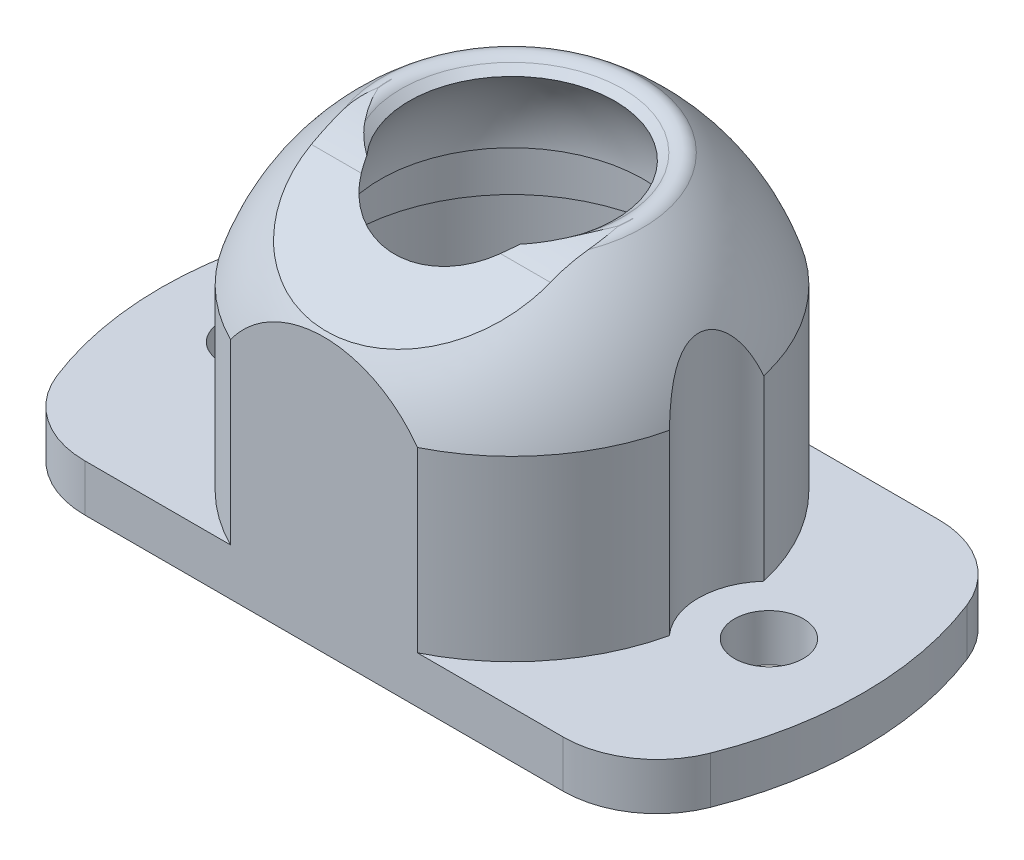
from build123d import *

# Parameters (mm, degrees)
ENL_V_MAT_EXTRU_1_DEPTH      = 10
ENL_V_MAT_EXTRU_1_DEPTH_BACK = 10
ESQUISSE2_W                  = 25.855913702
ESQUISSE2_H                  = 6.710438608
ESQUISSE3_R                  = 1.1
ENL_V_MAT_EXTRU_2_DEPTH      = 17.767185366
CONG_1_R                     = 3
ENL_V_MAT_EXTRU_3_DEPTH      = 15.575982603
ENL_V_MAT_EXTRU_3_DEPTH_BACK = 15.575982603
ESQUISSE5_R                  = 2.25
ENL_V_MAT_EXTRU_6_DEPTH      = 10


with BuildPart() as part:
    # Esquisse1 → R_volution1 (revolve)
    with BuildSketch(Plane.XY, mode=Mode.PRIVATE) as r_volution1_sk:
        with BuildLine():
            Line((4.2, 4.2), (5.2, 4.2))
            Line((5.2, 4.2), (5.2, 2.2))
            Line((5.2, 2.2), (5.7, 2.2))
            Line((5.7, 2.2), (5.7, -3.8))
            Line((5.7, -3.8), (11.203846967, -3.8))
            Line((11.203846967, -3.8), (11.203846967, -2.3))
            Line((11.203846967, -2.3), (6.7, -2.3))
            Line((6.7, -2.3), (6.7, 3.37628465))
            ThreePointArc((6.7, 3.37628465), (5.706557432, 5.395387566), (4.160733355, 7.03066511))
            ThreePointArc((4.160733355, 7.03066511), (3.850208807, 7.136734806), (3.540799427, 7.027454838))
            Line((3.540799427, 7.027454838), (3.281991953, 6.820787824))
            ThreePointArc((3.281991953, 6.820787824), (3.963859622, 5.588458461), (4.2, 4.2))
        make_face()
    revolve(r_volution1_sk.sketch.rotate(Axis((0, 0, 0), (0, 1, 0)), 90), axis=Axis((0, 0, 0), (0, 1, 0)))

    # Esquisse2 → Enl_v. mat.-Extru.1 (cut, two sides: drawn at the far end of the back side and taken through both)
    with BuildSketch(Plane(origin=(0, -2.3, 0), x_dir=(-1, 0, 0), z_dir=(0, 1, 0)).offset(-ENL_V_MAT_EXTRU_1_DEPTH_BACK)):
        with Locations((0.518477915, -9.355219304)):
            Rectangle(ESQUISSE2_W, ESQUISSE2_H)
        with Locations((0.518477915, 9.355219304)):
            Rectangle(ESQUISSE2_W, ESQUISSE2_H)
    extrude(amount=ENL_V_MAT_EXTRU_1_DEPTH + ENL_V_MAT_EXTRU_1_DEPTH_BACK, mode=Mode.SUBTRACT)

    # Esquisse3 → Enl_v. mat.-Extru.2 (cut, through all)
    with BuildSketch(Plane.XZ.offset(3.8)):
        with Locations(Location((8.2, 0, 0), (0, 0, 270))):
            Circle(ESQUISSE3_R)
        with Locations(Location((-8.2, 0, 0), (0, 0, 90))):
            Circle(ESQUISSE3_R)
    extrude(amount=-ENL_V_MAT_EXTRU_2_DEPTH, mode=Mode.SUBTRACT)

    # Cong_1
    cong_1_edges = [part.edges().sort_by_distance(p)[0] for p in [
        (9.461827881, -3.05, -6),
        (-9.461827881, -3.05, -6),
        (-9.461827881, -3.05, 6),
        (9.461827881, -3.05, 6),
    ]]
    fillet(cong_1_edges, radius=CONG_1_R)

    # Esquisse4 → Enl_v. mat.-Extru.3 (cut, two sides: drawn at the far end of the back side and taken through both)
    with BuildSketch(Plane(origin=(0, 0, 0), x_dir=(0, 0, -1), z_dir=(1, 0, 0)).offset(-ENL_V_MAT_EXTRU_3_DEPTH_BACK)):
        with BuildLine():
            Line((-2.589391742, 6.650032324), (-9.155944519, 3.519549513))
            Line((-9.155944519, 3.519549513), (-9.155944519, 10.558314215))
            Line((-9.155944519, 10.558314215), (0.302379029, 10.558314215))
            Line((0.302379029, 10.558314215), (0, 7.884477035))
            Line((0, 7.884477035), (0, 7.136678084))
            Line((0, 7.136678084), (-0.437733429, 7.136678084))
            ThreePointArc((-0.437733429, 7.136678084), (-1.540735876, 7.013499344), (-2.589391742, 6.650032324))
        make_face()
    extrude(amount=ENL_V_MAT_EXTRU_3_DEPTH + ENL_V_MAT_EXTRU_3_DEPTH_BACK, mode=Mode.SUBTRACT)

    # Esquisse5 → Enl_v. mat.-Extru.6 (cut)
    with BuildSketch(Plane(origin=(0, -2.3, 0), x_dir=(-1, 0, 0), z_dir=(0, 1, 0))):
        with Locations((-8.2, 0)):
            Circle(ESQUISSE5_R)
        with Locations((8.2, 0)):
            Circle(ESQUISSE5_R)
    extrude(amount=ENL_V_MAT_EXTRU_6_DEPTH, mode=Mode.SUBTRACT)


solid = part.part
